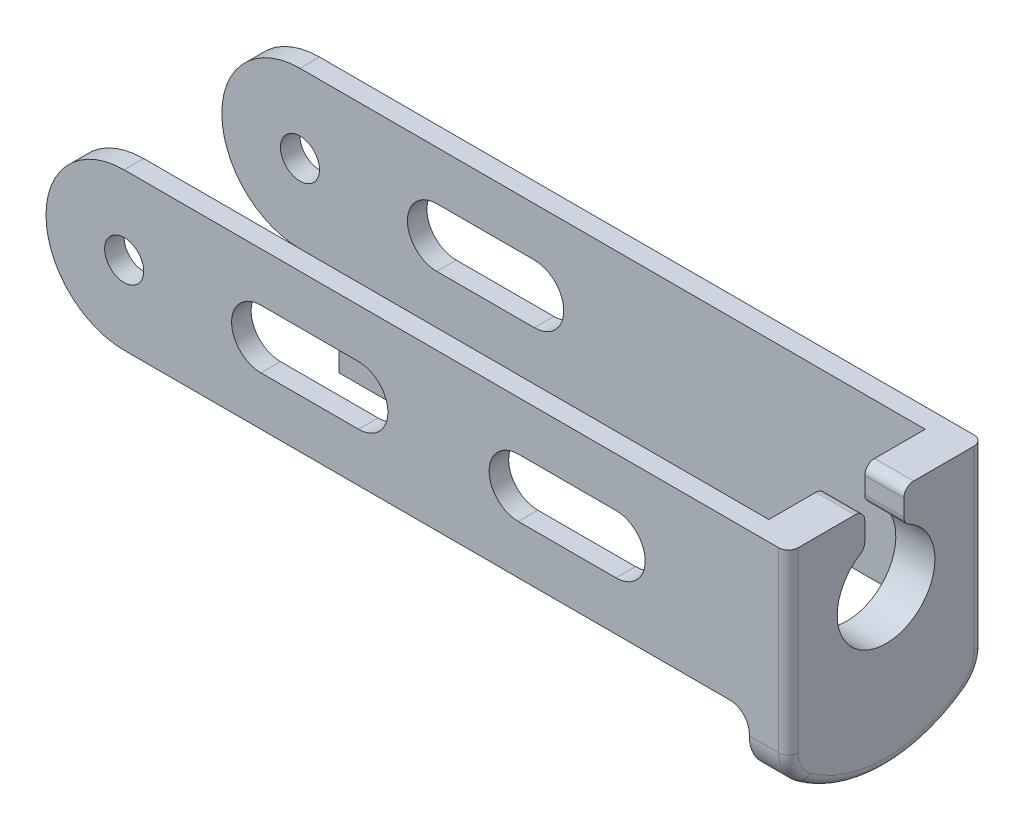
ISO-10303-21;
HEADER;
FILE_DESCRIPTION(('STEP AP214'),'2;1');
FILE_NAME('part.step','',(''),(''),'','','');
FILE_SCHEMA(('AUTOMOTIVE_DESIGN { 1 0 10303 214 1 1 1 1 }'));
ENDSEC;
DATA;
#1=APPLICATION_CONTEXT('core data for automotive mechanical design processes');
#2=APPLICATION_PROTOCOL_DEFINITION('international standard','automotive_design',2000,#1);
#3=PRODUCT_CONTEXT('',#1,'mechanical');
#4=PRODUCT('Part','Part','',(#3));
#5=PRODUCT_RELATED_PRODUCT_CATEGORY('part','',(#4));
#6=PRODUCT_DEFINITION_FORMATION('','',#4);
#7=PRODUCT_DEFINITION_CONTEXT('part definition',#1,'design');
#8=PRODUCT_DEFINITION('design','',#6,#7);
#9=PRODUCT_DEFINITION_SHAPE('','',#8);
#10=(LENGTH_UNIT() NAMED_UNIT(*) SI_UNIT(.MILLI.,.METRE.));
#11=(NAMED_UNIT(*) PLANE_ANGLE_UNIT() SI_UNIT($,.RADIAN.));
#12=(NAMED_UNIT(*) SI_UNIT($,.STERADIAN.) SOLID_ANGLE_UNIT());
#13=UNCERTAINTY_MEASURE_WITH_UNIT(LENGTH_MEASURE(1.E-05),#10,'distance_accuracy_value','');
#14=(GEOMETRIC_REPRESENTATION_CONTEXT(3) GLOBAL_UNCERTAINTY_ASSIGNED_CONTEXT((#13)) GLOBAL_UNIT_ASSIGNED_CONTEXT((#10,
#11,#12)) REPRESENTATION_CONTEXT('',''));
#15=CARTESIAN_POINT('',(0.,0.,0.));
#16=DIRECTION('',(0.,0.,1.));
#17=DIRECTION('',(1.,0.,0.));
#18=AXIS2_PLACEMENT_3D('',#15,#16,#17);
#19=CARTESIAN_POINT('',(0.,-3.,-10.));
#20=DIRECTION('',(0.,-1.,0.));
#21=DIRECTION('',(0.,0.,-1.));
#22=AXIS2_PLACEMENT_3D('',#19,#20,#21);
#23=PLANE('',#22);
#24=DIRECTION('',(0.,0.,1.));
#25=VECTOR('',#24,1.);
#26=CARTESIAN_POINT('',(-27.,-3.,-10.));
#27=LINE('',#26,#25);
#28=CARTESIAN_POINT('',(-27.,-3.,-10.));
#29=VERTEX_POINT('',#28);
#30=CARTESIAN_POINT('',(-27.,-3.,-9.));
#31=VERTEX_POINT('',#30);
#32=EDGE_CURVE('E319',#29,#31,#27,.T.);
#33=ORIENTED_EDGE('',*,*,#32,.T.);
#34=DIRECTION('',(1.,0.,0.));
#35=VECTOR('',#34,1.);
#36=CARTESIAN_POINT('',(0.,-3.,-9.));
#37=LINE('',#36,#35);
#38=CARTESIAN_POINT('',(-32.,-3.,-9.));
#39=VERTEX_POINT('',#38);
#40=EDGE_CURVE('E400',#39,#31,#37,.T.);
#41=ORIENTED_EDGE('',*,*,#40,.F.);
#42=DIRECTION('',(0.,0.,1.));
#43=VECTOR('',#42,1.);
#44=CARTESIAN_POINT('',(-32.,-3.,-10.));
#45=LINE('',#44,#43);
#46=CARTESIAN_POINT('',(-32.,-3.,-10.));
#47=VERTEX_POINT('',#46);
#48=EDGE_CURVE('E517',#47,#39,#45,.T.);
#49=ORIENTED_EDGE('',*,*,#48,.F.);
#50=DIRECTION('',(1.,0.,0.));
#51=VECTOR('',#50,1.);
#52=CARTESIAN_POINT('',(0.,-3.,-10.));
#53=LINE('',#52,#51);
#54=EDGE_CURVE('E500',#47,#29,#53,.T.);
#55=ORIENTED_EDGE('',*,*,#54,.T.);
#56=EDGE_LOOP('',(#33,#41,#49,#55));
#57=FACE_BOUND('',#56,.T.);
#58=ADVANCED_FACE('F32',(#57),#23,.T.);
#59=CARTESIAN_POINT('',(2.,5.,-10.));
#60=DIRECTION('',(1.,0.,0.));
#61=DIRECTION('',(0.,1.,0.));
#62=AXIS2_PLACEMENT_3D('',#59,#60,#61);
#63=PLANE('',#62);
#64=DIRECTION('',(0.,0.,1.));
#65=VECTOR('',#64,1.);
#66=CARTESIAN_POINT('',(2.,5.,-10.));
#67=LINE('',#66,#65);
#68=CARTESIAN_POINT('',(2.,5.,-3.41));
#69=VERTEX_POINT('',#68);
#70=CARTESIAN_POINT('',(2.,5.,-0.5));
#71=VERTEX_POINT('',#70);
#72=EDGE_CURVE('E516',#69,#71,#67,.T.);
#73=ORIENTED_EDGE('',*,*,#72,.T.);
#74=DIRECTION('',(0.,1.,0.));
#75=VECTOR('',#74,1.);
#76=CARTESIAN_POINT('',(2.,-4.08848734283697,-0.5));
#77=LINE('',#76,#75);
#78=CARTESIAN_POINT('',(2.,-4.08848734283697,-0.5));
#79=VERTEX_POINT('',#78);
#80=EDGE_CURVE('E625',#71,#79,#77,.F.);
#81=ORIENTED_EDGE('',*,*,#80,.T.);
#82=CARTESIAN_POINT('',(2.,-4.08848734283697,-2.));
#83=DIRECTION('',(1.,0.,0.));
#84=DIRECTION('',(0.,1.,0.));
#85=AXIS2_PLACEMENT_3D('',#82,#83,#84);
#86=CIRCLE('',#85,1.5);
#87=CARTESIAN_POINT('',(2.,-5.2978442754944,-1.11261293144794));
#88=VERTEX_POINT('',#87);
#89=EDGE_CURVE('E623',#79,#88,#86,.T.);
#90=ORIENTED_EDGE('',*,*,#89,.T.);
#91=CARTESIAN_POINT('',(2.,0.,-5.));
#92=DIRECTION('',(1.,0.,0.));
#93=DIRECTION('',(0.,1.,0.));
#94=AXIS2_PLACEMENT_3D('',#91,#92,#93);
#95=CIRCLE('',#94,6.57106781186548);
#96=CARTESIAN_POINT('',(2.,-5.2978442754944,-8.88738706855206));
#97=VERTEX_POINT('',#96);
#98=EDGE_CURVE('E621',#88,#97,#95,.T.);
#99=ORIENTED_EDGE('',*,*,#98,.T.);
#100=CARTESIAN_POINT('',(2.,-4.08848734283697,-8.));
#101=DIRECTION('',(1.,0.,0.));
#102=DIRECTION('',(0.,1.,0.));
#103=AXIS2_PLACEMENT_3D('',#100,#101,#102);
#104=CIRCLE('',#103,1.5);
#105=CARTESIAN_POINT('',(2.,-4.08848734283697,-9.5));
#106=VERTEX_POINT('',#105);
#107=EDGE_CURVE('E619',#97,#106,#104,.T.);
#108=ORIENTED_EDGE('',*,*,#107,.T.);
#109=DIRECTION('',(0.,1.,0.));
#110=VECTOR('',#109,1.);
#111=CARTESIAN_POINT('',(2.,5.,-9.5));
#112=LINE('',#111,#110);
#113=CARTESIAN_POINT('',(2.,5.,-9.5));
#114=VERTEX_POINT('',#113);
#115=EDGE_CURVE('E617',#106,#114,#112,.T.);
#116=ORIENTED_EDGE('',*,*,#115,.T.);
#117=CARTESIAN_POINT('',(2.,5.,-6.41));
#118=VERTEX_POINT('',#117);
#119=EDGE_CURVE('E514',#114,#118,#67,.T.);
#120=ORIENTED_EDGE('',*,*,#119,.T.);
#121=CARTESIAN_POINT('',(2.,4.5,-6.41));
#122=DIRECTION('',(1.,0.,0.));
#123=DIRECTION('',(0.,1.,0.));
#124=AXIS2_PLACEMENT_3D('',#121,#122,#123);
#125=CIRCLE('',#124,0.5);
#126=CARTESIAN_POINT('',(2.,4.5,-5.91));
#127=VERTEX_POINT('',#126);
#128=EDGE_CURVE('E591',#118,#127,#125,.T.);
#129=ORIENTED_EDGE('',*,*,#128,.T.);
#130=DIRECTION('',(0.,1.,0.));
#131=VECTOR('',#130,1.);
#132=CARTESIAN_POINT('',(2.,5.,-5.91));
#133=LINE('',#132,#131);
#134=CARTESIAN_POINT('',(2.,3.64799924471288,-5.91));
#135=VERTEX_POINT('',#134);
#136=EDGE_CURVE('E371',#135,#127,#133,.T.);
#137=ORIENTED_EDGE('',*,*,#136,.F.);
#138=CARTESIAN_POINT('',(2.,3.64799924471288,-6.41));
#139=DIRECTION('',(1.,0.,0.));
#140=DIRECTION('',(0.,1.,0.));
#141=AXIS2_PLACEMENT_3D('',#138,#139,#140);
#142=CIRCLE('',#141,0.5);
#143=CARTESIAN_POINT('',(2.,3.20666603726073,-6.175));
#144=VERTEX_POINT('',#143);
#145=EDGE_CURVE('E553',#135,#144,#142,.T.);
#146=ORIENTED_EDGE('',*,*,#145,.T.);
#147=CARTESIAN_POINT('',(2.,0.999999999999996,-5.));
#148=DIRECTION('',(1.,0.,0.));
#149=DIRECTION('',(0.,1.,0.));
#150=AXIS2_PLACEMENT_3D('',#147,#148,#149);
#151=CIRCLE('',#150,2.5);
#152=CARTESIAN_POINT('',(2.,3.11999410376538,-3.675));
#153=VERTEX_POINT('',#152);
#154=EDGE_CURVE('E379',#144,#153,#151,.F.);
#155=ORIENTED_EDGE('',*,*,#154,.T.);
#156=CARTESIAN_POINT('',(2.,3.54399292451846,-3.41));
#157=DIRECTION('',(1.,0.,0.));
#158=DIRECTION('',(0.,1.,0.));
#159=AXIS2_PLACEMENT_3D('',#156,#157,#158);
#160=CIRCLE('',#159,0.5);
#161=CARTESIAN_POINT('',(2.,3.54399292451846,-3.91));
#162=VERTEX_POINT('',#161);
#163=EDGE_CURVE('E550',#153,#162,#160,.T.);
#164=ORIENTED_EDGE('',*,*,#163,.T.);
#165=DIRECTION('',(0.,-1.,0.));
#166=VECTOR('',#165,1.);
#167=CARTESIAN_POINT('',(2.,2.30198104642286,-3.91));
#168=LINE('',#167,#166);
#169=CARTESIAN_POINT('',(2.,4.5,-3.91));
#170=VERTEX_POINT('',#169);
#171=EDGE_CURVE('E374',#170,#162,#168,.T.);
#172=ORIENTED_EDGE('',*,*,#171,.F.);
#173=CARTESIAN_POINT('',(2.,4.5,-3.41));
#174=DIRECTION('',(1.,0.,0.));
#175=DIRECTION('',(0.,1.,0.));
#176=AXIS2_PLACEMENT_3D('',#173,#174,#175);
#177=CIRCLE('',#176,0.5);
#178=EDGE_CURVE('E589',#170,#69,#177,.T.);
#179=ORIENTED_EDGE('',*,*,#178,.T.);
#180=EDGE_LOOP('',(#73,#81,#90,#99,#108,#116,#120,#129,#137,#146,#155,#164,#172,#179));
#181=FACE_BOUND('',#180,.T.);
#182=ADVANCED_FACE('F714',(#181),#63,.T.);
#183=CARTESIAN_POINT('',(0.,-3.,-10.));
#184=DIRECTION('',(-1.,0.,0.));
#185=DIRECTION('',(0.,-1.,0.));
#186=AXIS2_PLACEMENT_3D('',#183,#184,#185);
#187=PLANE('',#186);
#188=DIRECTION('',(0.,-1.,0.));
#189=VECTOR('',#188,1.);
#190=CARTESIAN_POINT('',(0.,-3.,-10.));
#191=LINE('',#190,#189);
#192=CARTESIAN_POINT('',(0.,-4.,-10.));
#193=VERTEX_POINT('',#192);
#194=CARTESIAN_POINT('',(0.,-4.08848734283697,-10.));
#195=VERTEX_POINT('',#194);
#196=EDGE_CURVE('E503',#193,#195,#191,.T.);
#197=ORIENTED_EDGE('',*,*,#196,.T.);
#198=CARTESIAN_POINT('',(0.,-4.08848734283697,-8.));
#199=DIRECTION('',(-1.,0.,0.));
#200=DIRECTION('',(0.,-1.,0.));
#201=AXIS2_PLACEMENT_3D('',#198,#199,#200);
#202=CIRCLE('',#201,2.);
#203=CARTESIAN_POINT('',(0.,-5.70096325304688,-9.18318275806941));
#204=VERTEX_POINT('',#203);
#205=EDGE_CURVE('E610',#195,#204,#202,.T.);
#206=ORIENTED_EDGE('',*,*,#205,.T.);
#207=CARTESIAN_POINT('',(0.,0.,-5.));
#208=DIRECTION('',(-1.,0.,0.));
#209=DIRECTION('',(0.,1.,0.));
#210=AXIS2_PLACEMENT_3D('',#207,#208,#209);
#211=CIRCLE('',#210,7.07106781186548);
#212=CARTESIAN_POINT('',(0.,-5.70096325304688,-0.81681724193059));
#213=VERTEX_POINT('',#212);
#214=EDGE_CURVE('E382',#204,#213,#211,.T.);
#215=ORIENTED_EDGE('',*,*,#214,.T.);
#216=CARTESIAN_POINT('',(0.,-4.08848734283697,-2.));
#217=DIRECTION('',(-1.,0.,0.));
#218=DIRECTION('',(0.,-1.,0.));
#219=AXIS2_PLACEMENT_3D('',#216,#217,#218);
#220=CIRCLE('',#219,2.);
#221=CARTESIAN_POINT('',(0.,-4.08848734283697,0.));
#222=VERTEX_POINT('',#221);
#223=EDGE_CURVE('E603',#213,#222,#220,.T.);
#224=ORIENTED_EDGE('',*,*,#223,.T.);
#225=DIRECTION('',(0.,-1.,0.));
#226=VECTOR('',#225,1.);
#227=CARTESIAN_POINT('',(0.,-3.,0.));
#228=LINE('',#227,#226);
#229=CARTESIAN_POINT('',(0.,-4.,0.));
#230=VERTEX_POINT('',#229);
#231=EDGE_CURVE('E491',#230,#222,#228,.T.);
#232=ORIENTED_EDGE('',*,*,#231,.F.);
#233=DIRECTION('',(0.,0.,1.));
#234=VECTOR('',#233,1.);
#235=CARTESIAN_POINT('',(0.,-4.,-10.));
#236=LINE('',#235,#234);
#237=CARTESIAN_POINT('',(0.,-4.,-0.999999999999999));
#238=VERTEX_POINT('',#237);
#239=EDGE_CURVE('E524',#230,#238,#236,.F.);
#240=ORIENTED_EDGE('',*,*,#239,.T.);
#241=DIRECTION('',(0.,1.,0.));
#242=VECTOR('',#241,1.);
#243=CARTESIAN_POINT('',(0.,-5.,-0.999999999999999));
#244=LINE('',#243,#242);
#245=CARTESIAN_POINT('',(0.,5.,-0.999999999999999));
#246=VERTEX_POINT('',#245);
#247=EDGE_CURVE('E393',#238,#246,#244,.T.);
#248=ORIENTED_EDGE('',*,*,#247,.T.);
#249=DIRECTION('',(0.,0.,-1.));
#250=VECTOR('',#249,1.);
#251=CARTESIAN_POINT('',(0.,5.,-9.));
#252=LINE('',#251,#250);
#253=CARTESIAN_POINT('',(0.,5.,-3.41));
#254=VERTEX_POINT('',#253);
#255=EDGE_CURVE('E388',#246,#254,#252,.T.);
#256=ORIENTED_EDGE('',*,*,#255,.T.);
#257=CARTESIAN_POINT('',(0.,4.5,-3.41));
#258=DIRECTION('',(-1.,0.,0.));
#259=DIRECTION('',(0.,-1.,0.));
#260=AXIS2_PLACEMENT_3D('',#257,#258,#259);
#261=CIRCLE('',#260,0.5);
#262=CARTESIAN_POINT('',(0.,4.5,-3.91));
#263=VERTEX_POINT('',#262);
#264=EDGE_CURVE('E582',#254,#263,#261,.T.);
#265=ORIENTED_EDGE('',*,*,#264,.T.);
#266=DIRECTION('',(0.,-1.,0.));
#267=VECTOR('',#266,1.);
#268=CARTESIAN_POINT('',(0.,2.30198104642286,-3.91));
#269=LINE('',#268,#267);
#270=CARTESIAN_POINT('',(0.,3.54399292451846,-3.91));
#271=VERTEX_POINT('',#270);
#272=EDGE_CURVE('E369',#263,#271,#269,.T.);
#273=ORIENTED_EDGE('',*,*,#272,.T.);
#274=CARTESIAN_POINT('',(0.,3.54399292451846,-3.41));
#275=DIRECTION('',(-1.,0.,0.));
#276=DIRECTION('',(0.,-1.,0.));
#277=AXIS2_PLACEMENT_3D('',#274,#275,#276);
#278=CIRCLE('',#277,0.5);
#279=CARTESIAN_POINT('',(0.,3.11999410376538,-3.675));
#280=VERTEX_POINT('',#279);
#281=EDGE_CURVE('E544',#271,#280,#278,.T.);
#282=ORIENTED_EDGE('',*,*,#281,.T.);
#283=CARTESIAN_POINT('',(0.,0.999999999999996,-5.));
#284=DIRECTION('',(1.,0.,0.));
#285=DIRECTION('',(0.,0.,-1.));
#286=AXIS2_PLACEMENT_3D('',#283,#284,#285);
#287=CIRCLE('',#286,2.5);
#288=CARTESIAN_POINT('',(0.,3.20666603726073,-6.175));
#289=VERTEX_POINT('',#288);
#290=EDGE_CURVE('E376',#280,#289,#287,.T.);
#291=ORIENTED_EDGE('',*,*,#290,.T.);
#292=CARTESIAN_POINT('',(0.,3.64799924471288,-6.41));
#293=DIRECTION('',(-1.,0.,0.));
#294=DIRECTION('',(0.,-1.,0.));
#295=AXIS2_PLACEMENT_3D('',#292,#293,#294);
#296=CIRCLE('',#295,0.5);
#297=CARTESIAN_POINT('',(0.,3.64799924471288,-5.91));
#298=VERTEX_POINT('',#297);
#299=EDGE_CURVE('E546',#289,#298,#296,.T.);
#300=ORIENTED_EDGE('',*,*,#299,.T.);
#301=DIRECTION('',(0.,1.,0.));
#302=VECTOR('',#301,1.);
#303=CARTESIAN_POINT('',(0.,5.,-5.91));
#304=LINE('',#303,#302);
#305=CARTESIAN_POINT('',(0.,4.5,-5.91));
#306=VERTEX_POINT('',#305);
#307=EDGE_CURVE('E360',#298,#306,#304,.T.);
#308=ORIENTED_EDGE('',*,*,#307,.T.);
#309=CARTESIAN_POINT('',(0.,4.5,-6.41));
#310=DIRECTION('',(-1.,0.,0.));
#311=DIRECTION('',(0.,-1.,0.));
#312=AXIS2_PLACEMENT_3D('',#309,#310,#311);
#313=CIRCLE('',#312,0.5);
#314=CARTESIAN_POINT('',(0.,5.,-6.41));
#315=VERTEX_POINT('',#314);
#316=EDGE_CURVE('E584',#306,#315,#313,.T.);
#317=ORIENTED_EDGE('',*,*,#316,.T.);
#318=CARTESIAN_POINT('',(0.,5.,-9.));
#319=VERTEX_POINT('',#318);
#320=EDGE_CURVE('E387',#315,#319,#252,.T.);
#321=ORIENTED_EDGE('',*,*,#320,.T.);
#322=DIRECTION('',(0.,1.,0.));
#323=VECTOR('',#322,1.);
#324=CARTESIAN_POINT('',(0.,-5.,-9.));
#325=LINE('',#324,#323);
#326=CARTESIAN_POINT('',(0.,-4.,-9.));
#327=VERTEX_POINT('',#326);
#328=EDGE_CURVE('E394',#327,#319,#325,.T.);
#329=ORIENTED_EDGE('',*,*,#328,.F.);
#330=EDGE_CURVE('E523',#327,#193,#236,.F.);
#331=ORIENTED_EDGE('',*,*,#330,.T.);
#332=EDGE_LOOP('',(#197,#206,#215,#224,#232,#240,#248,#256,#265,#273,#282,#291,#300,#308,#317,
#321,#329,#331));
#333=FACE_BOUND('',#332,.T.);
#334=ADVANCED_FACE('F677',(#333),#187,.T.);
#335=CARTESIAN_POINT('',(-32.,5.,-10.));
#336=DIRECTION('',(0.,1.,0.));
#337=DIRECTION('',(0.,0.,1.));
#338=AXIS2_PLACEMENT_3D('',#335,#336,#337);
#339=PLANE('',#338);
#340=ORIENTED_EDGE('',*,*,#119,.F.);
#341=CARTESIAN_POINT('',(1.5,5.,-9.5));
#342=DIRECTION('',(0.,1.,0.));
#343=DIRECTION('',(0.,0.,1.));
#344=AXIS2_PLACEMENT_3D('',#341,#342,#343);
#345=CIRCLE('',#344,0.5);
#346=CARTESIAN_POINT('',(1.5,5.,-10.));
#347=VERTEX_POINT('',#346);
#348=EDGE_CURVE('E40',#114,#347,#345,.T.);
#349=ORIENTED_EDGE('',*,*,#348,.T.);
#350=DIRECTION('',(-1.,0.,0.));
#351=VECTOR('',#350,1.);
#352=CARTESIAN_POINT('',(-32.,5.,-10.));
#353=LINE('',#352,#351);
#354=CARTESIAN_POINT('',(-32.,5.,-10.));
#355=VERTEX_POINT('',#354);
#356=EDGE_CURVE('E506',#347,#355,#353,.T.);
#357=ORIENTED_EDGE('',*,*,#356,.T.);
#358=DIRECTION('',(0.,0.,1.));
#359=VECTOR('',#358,1.);
#360=CARTESIAN_POINT('',(-32.,5.,-10.));
#361=LINE('',#360,#359);
#362=CARTESIAN_POINT('',(-32.,5.,-9.));
#363=VERTEX_POINT('',#362);
#364=EDGE_CURVE('E509',#355,#363,#361,.T.);
#365=ORIENTED_EDGE('',*,*,#364,.T.);
#366=DIRECTION('',(-1.,0.,0.));
#367=VECTOR('',#366,1.);
#368=CARTESIAN_POINT('',(0.,5.,-9.));
#369=LINE('',#368,#367);
#370=EDGE_CURVE('E391',#319,#363,#369,.T.);
#371=ORIENTED_EDGE('',*,*,#370,.F.);
#372=ORIENTED_EDGE('',*,*,#320,.F.);
#373=DIRECTION('',(-1.,0.,0.));
#374=VECTOR('',#373,1.);
#375=CARTESIAN_POINT('',(-32.,5.,-6.41));
#376=LINE('',#375,#374);
#377=EDGE_CURVE('E586',#315,#118,#376,.F.);
#378=ORIENTED_EDGE('',*,*,#377,.T.);
#379=EDGE_LOOP('',(#340,#349,#357,#365,#371,#372,#378));
#380=FACE_BOUND('',#379,.T.);
#381=ADVANCED_FACE('F779',(#380),#339,.T.);
#382=DIRECTION('',(-1.,0.,0.));
#383=VECTOR('',#382,1.);
#384=CARTESIAN_POINT('',(-32.,5.,0.));
#385=LINE('',#384,#383);
#386=CARTESIAN_POINT('',(1.5,5.,0.));
#387=VERTEX_POINT('',#386);
#388=CARTESIAN_POINT('',(-32.,5.,0.));
#389=VERTEX_POINT('',#388);
#390=EDGE_CURVE('E494',#387,#389,#385,.T.);
#391=ORIENTED_EDGE('',*,*,#390,.F.);
#392=CARTESIAN_POINT('',(1.5,5.,-0.5));
#393=DIRECTION('',(0.,1.,0.));
#394=DIRECTION('',(0.,0.,1.));
#395=AXIS2_PLACEMENT_3D('',#392,#393,#394);
#396=CIRCLE('',#395,0.5);
#397=EDGE_CURVE('E615',#387,#71,#396,.T.);
#398=ORIENTED_EDGE('',*,*,#397,.T.);
#399=ORIENTED_EDGE('',*,*,#72,.F.);
#400=DIRECTION('',(-1.,0.,0.));
#401=VECTOR('',#400,1.);
#402=CARTESIAN_POINT('',(-32.,5.,-3.41));
#403=LINE('',#402,#401);
#404=EDGE_CURVE('E593',#69,#254,#403,.T.);
#405=ORIENTED_EDGE('',*,*,#404,.T.);
#406=ORIENTED_EDGE('',*,*,#255,.F.);
#407=DIRECTION('',(1.,0.,0.));
#408=VECTOR('',#407,1.);
#409=CARTESIAN_POINT('',(0.,5.,-0.999999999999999));
#410=LINE('',#409,#408);
#411=CARTESIAN_POINT('',(-32.,5.,-1.));
#412=VERTEX_POINT('',#411);
#413=EDGE_CURVE('E385',#412,#246,#410,.T.);
#414=ORIENTED_EDGE('',*,*,#413,.F.);
#415=EDGE_CURVE('E513',#412,#389,#361,.T.);
#416=ORIENTED_EDGE('',*,*,#415,.T.);
#417=EDGE_LOOP('',(#391,#398,#399,#405,#406,#414,#416));
#418=FACE_BOUND('',#417,.T.);
#419=ADVANCED_FACE('F699',(#418),#339,.T.);
#420=CARTESIAN_POINT('',(3.,0.999999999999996,-5.));
#421=DIRECTION('',(-1.,0.,0.));
#422=DIRECTION('',(0.,0.,1.));
#423=AXIS2_PLACEMENT_3D('',#420,#421,#422);
#424=CYLINDRICAL_SURFACE('',#423,2.5);
#425=ORIENTED_EDGE('',*,*,#154,.F.);
#426=DIRECTION('',(-1.,0.,0.));
#427=VECTOR('',#426,1.);
#428=CARTESIAN_POINT('',(3.,3.20666603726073,-6.175));
#429=LINE('',#428,#427);
#430=EDGE_CURVE('E541',#144,#289,#429,.T.);
#431=ORIENTED_EDGE('',*,*,#430,.T.);
#432=ORIENTED_EDGE('',*,*,#290,.F.);
#433=DIRECTION('',(-1.,0.,0.));
#434=VECTOR('',#433,1.);
#435=CARTESIAN_POINT('',(3.,3.11999410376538,-3.675));
#436=LINE('',#435,#434);
#437=EDGE_CURVE('E538',#280,#153,#436,.F.);
#438=ORIENTED_EDGE('',*,*,#437,.T.);
#439=EDGE_LOOP('',(#425,#431,#432,#438));
#440=FACE_BOUND('',#439,.T.);
#441=ADVANCED_FACE('F797',(#440),#424,.F.);
#442=CARTESIAN_POINT('',(-32.,0.999999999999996,-10.));
#443=DIRECTION('',(0.,0.,1.));
#444=DIRECTION('',(1.,0.,0.));
#445=AXIS2_PLACEMENT_3D('',#442,#443,#444);
#446=CYLINDRICAL_SURFACE('',#445,4.);
#447=CARTESIAN_POINT('',(-32.,0.999999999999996,-0.999999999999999));
#448=DIRECTION('',(0.,0.,1.));
#449=DIRECTION('',(1.,0.,0.));
#450=AXIS2_PLACEMENT_3D('',#447,#448,#449);
#451=CIRCLE('',#450,4.);
#452=CARTESIAN_POINT('',(-32.,-3.,-1.));
#453=VERTEX_POINT('',#452);
#454=EDGE_CURVE('E423',#453,#412,#451,.F.);
#455=ORIENTED_EDGE('',*,*,#454,.F.);
#456=CARTESIAN_POINT('',(-32.,-3.,0.));
#457=VERTEX_POINT('',#456);
#458=EDGE_CURVE('E508',#453,#457,#45,.T.);
#459=ORIENTED_EDGE('',*,*,#458,.T.);
#460=CARTESIAN_POINT('',(-32.,0.999999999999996,0.));
#461=DIRECTION('',(0.,0.,1.));
#462=DIRECTION('',(-1.,0.,0.));
#463=AXIS2_PLACEMENT_3D('',#460,#461,#462);
#464=CIRCLE('',#463,4.);
#465=EDGE_CURVE('E474',#389,#457,#464,.T.);
#466=ORIENTED_EDGE('',*,*,#465,.F.);
#467=ORIENTED_EDGE('',*,*,#415,.F.);
#468=EDGE_LOOP('',(#455,#459,#466,#467));
#469=FACE_BOUND('',#468,.T.);
#470=ADVANCED_FACE('F693',(#469),#446,.T.);
#471=DIRECTION('',(0.,0.,1.));
#472=VECTOR('',#471,1.);
#473=CARTESIAN_POINT('',(-1.,-3.,0.));
#474=LINE('',#473,#472);
#475=CARTESIAN_POINT('',(-1.,-3.,-0.999999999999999));
#476=VERTEX_POINT('',#475);
#477=CARTESIAN_POINT('',(-1.,-3.,0.));
#478=VERTEX_POINT('',#477);
#479=EDGE_CURVE('E512',#476,#478,#474,.T.);
#480=ORIENTED_EDGE('',*,*,#479,.T.);
#481=DIRECTION('',(1.,0.,0.));
#482=VECTOR('',#481,1.);
#483=CARTESIAN_POINT('',(0.,-3.,0.));
#484=LINE('',#483,#482);
#485=EDGE_CURVE('E489',#457,#478,#484,.T.);
#486=ORIENTED_EDGE('',*,*,#485,.F.);
#487=ORIENTED_EDGE('',*,*,#458,.F.);
#488=DIRECTION('',(-1.,0.,0.));
#489=VECTOR('',#488,1.);
#490=CARTESIAN_POINT('',(0.,-3.,-0.999999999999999));
#491=LINE('',#490,#489);
#492=EDGE_CURVE('E421',#476,#453,#491,.T.);
#493=ORIENTED_EDGE('',*,*,#492,.F.);
#494=EDGE_LOOP('',(#480,#486,#487,#493));
#495=FACE_BOUND('',#494,.T.);
#496=ADVANCED_FACE('F689',(#495),#23,.T.);
#497=CARTESIAN_POINT('',(-25.,0.999999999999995,-10.));
#498=DIRECTION('',(0.,0.,1.));
#499=DIRECTION('',(1.,0.,0.));
#500=AXIS2_PLACEMENT_3D('',#497,#498,#499);
#501=CYLINDRICAL_SURFACE('',#500,1.5);
#502=DIRECTION('',(0.,0.,1.));
#503=VECTOR('',#502,1.);
#504=CARTESIAN_POINT('',(-25.,-0.500000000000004,-10.));
#505=LINE('',#504,#503);
#506=CARTESIAN_POINT('',(-25.,-0.500000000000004,-0.999999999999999));
#507=VERTEX_POINT('',#506);
#508=CARTESIAN_POINT('',(-25.,-0.500000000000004,0.));
#509=VERTEX_POINT('',#508);
#510=EDGE_CURVE('E470',#507,#509,#505,.T.);
#511=ORIENTED_EDGE('',*,*,#510,.F.);
#512=CARTESIAN_POINT('',(-25.,0.999999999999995,-0.999999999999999));
#513=DIRECTION('',(0.,0.,1.));
#514=DIRECTION('',(1.,0.,0.));
#515=AXIS2_PLACEMENT_3D('',#512,#513,#514);
#516=CIRCLE('',#515,1.5);
#517=CARTESIAN_POINT('',(-25.,2.5,-0.999999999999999));
#518=VERTEX_POINT('',#517);
#519=EDGE_CURVE('E437',#507,#518,#516,.F.);
#520=ORIENTED_EDGE('',*,*,#519,.T.);
#521=DIRECTION('',(0.,0.,1.));
#522=VECTOR('',#521,1.);
#523=CARTESIAN_POINT('',(-25.,2.5,-10.));
#524=LINE('',#523,#522);
#525=CARTESIAN_POINT('',(-25.,2.5,0.));
#526=VERTEX_POINT('',#525);
#527=EDGE_CURVE('E475',#518,#526,#524,.T.);
#528=ORIENTED_EDGE('',*,*,#527,.T.);
#529=CARTESIAN_POINT('',(-25.,0.999999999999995,0.));
#530=DIRECTION('',(0.,0.,1.));
#531=DIRECTION('',(1.,0.,0.));
#532=AXIS2_PLACEMENT_3D('',#529,#530,#531);
#533=CIRCLE('',#532,1.5);
#534=EDGE_CURVE('E446',#526,#509,#533,.T.);
#535=ORIENTED_EDGE('',*,*,#534,.T.);
#536=EDGE_LOOP('',(#511,#520,#528,#535));
#537=FACE_BOUND('',#536,.T.);
#538=ADVANCED_FACE('F740',(#537),#501,.F.);
#539=CARTESIAN_POINT('',(-25.,2.5,-10.));
#540=DIRECTION('',(0.,1.,0.));
#541=DIRECTION('',(-1.,0.,0.));
#542=AXIS2_PLACEMENT_3D('',#539,#540,#541);
#543=PLANE('',#542);
#544=ORIENTED_EDGE('',*,*,#527,.F.);
#545=DIRECTION('',(1.,0.,0.));
#546=VECTOR('',#545,1.);
#547=CARTESIAN_POINT('',(-25.,2.5,-0.999999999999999));
#548=LINE('',#547,#546);
#549=CARTESIAN_POINT('',(-20.,2.5,-0.999999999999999));
#550=VERTEX_POINT('',#549);
#551=EDGE_CURVE('E434',#518,#550,#548,.T.);
#552=ORIENTED_EDGE('',*,*,#551,.T.);
#553=DIRECTION('',(0.,0.,1.));
#554=VECTOR('',#553,1.);
#555=CARTESIAN_POINT('',(-20.,2.5,-10.));
#556=LINE('',#555,#554);
#557=CARTESIAN_POINT('',(-20.,2.5,0.));
#558=VERTEX_POINT('',#557);
#559=EDGE_CURVE('E479',#550,#558,#556,.T.);
#560=ORIENTED_EDGE('',*,*,#559,.T.);
#561=DIRECTION('',(-1.,0.,0.));
#562=VECTOR('',#561,1.);
#563=CARTESIAN_POINT('',(-25.,2.5,0.));
#564=LINE('',#563,#562);
#565=EDGE_CURVE('E455',#558,#526,#564,.T.);
#566=ORIENTED_EDGE('',*,*,#565,.T.);
#567=EDGE_LOOP('',(#544,#552,#560,#566));
#568=FACE_BOUND('',#567,.T.);
#569=ADVANCED_FACE('F843',(#568),#543,.F.);
#570=CARTESIAN_POINT('',(-20.,0.999999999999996,-10.));
#571=DIRECTION('',(0.,0.,1.));
#572=DIRECTION('',(1.,0.,0.));
#573=AXIS2_PLACEMENT_3D('',#570,#571,#572);
#574=CYLINDRICAL_SURFACE('',#573,1.5);
#575=ORIENTED_EDGE('',*,*,#559,.F.);
#576=CARTESIAN_POINT('',(-20.,0.999999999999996,-0.999999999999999));
#577=DIRECTION('',(0.,0.,1.));
#578=DIRECTION('',(1.,0.,0.));
#579=AXIS2_PLACEMENT_3D('',#576,#577,#578);
#580=CIRCLE('',#579,1.5);
#581=CARTESIAN_POINT('',(-20.,-0.500000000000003,-0.999999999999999));
#582=VERTEX_POINT('',#581);
#583=EDGE_CURVE('E431',#550,#582,#580,.F.);
#584=ORIENTED_EDGE('',*,*,#583,.T.);
#585=DIRECTION('',(0.,0.,1.));
#586=VECTOR('',#585,1.);
#587=CARTESIAN_POINT('',(-20.,-0.500000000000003,-10.));
#588=LINE('',#587,#586);
#589=CARTESIAN_POINT('',(-20.,-0.500000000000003,0.));
#590=VERTEX_POINT('',#589);
#591=EDGE_CURVE('E483',#582,#590,#588,.T.);
#592=ORIENTED_EDGE('',*,*,#591,.T.);
#593=CARTESIAN_POINT('',(-20.,0.999999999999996,0.));
#594=DIRECTION('',(0.,0.,1.));
#595=DIRECTION('',(-1.,0.,0.));
#596=AXIS2_PLACEMENT_3D('',#593,#594,#595);
#597=CIRCLE('',#596,1.5);
#598=EDGE_CURVE('E452',#590,#558,#597,.T.);
#599=ORIENTED_EDGE('',*,*,#598,.T.);
#600=EDGE_LOOP('',(#575,#584,#592,#599));
#601=FACE_BOUND('',#600,.T.);
#602=ADVANCED_FACE('F847',(#601),#574,.F.);
#603=CARTESIAN_POINT('',(-20.,-0.500000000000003,-10.));
#604=DIRECTION('',(0.,-1.,0.));
#605=DIRECTION('',(1.,0.,0.));
#606=AXIS2_PLACEMENT_3D('',#603,#604,#605);
#607=PLANE('',#606);
#608=ORIENTED_EDGE('',*,*,#591,.F.);
#609=DIRECTION('',(-1.,0.,0.));
#610=VECTOR('',#609,1.);
#611=CARTESIAN_POINT('',(-20.,-0.500000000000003,-0.999999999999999));
#612=LINE('',#611,#610);
#613=EDGE_CURVE('E428',#582,#507,#612,.T.);
#614=ORIENTED_EDGE('',*,*,#613,.T.);
#615=ORIENTED_EDGE('',*,*,#510,.T.);
#616=DIRECTION('',(1.,0.,0.));
#617=VECTOR('',#616,1.);
#618=CARTESIAN_POINT('',(-20.,-0.500000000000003,0.));
#619=LINE('',#618,#617);
#620=EDGE_CURVE('E449',#509,#590,#619,.T.);
#621=ORIENTED_EDGE('',*,*,#620,.T.);
#622=EDGE_LOOP('',(#608,#614,#615,#621));
#623=FACE_BOUND('',#622,.T.);
#624=ADVANCED_FACE('F851',(#623),#607,.F.);
#625=CARTESIAN_POINT('',(-32.,0.999999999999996,-10.));
#626=DIRECTION('',(0.,0.,1.));
#627=DIRECTION('',(1.,0.,0.));
#628=AXIS2_PLACEMENT_3D('',#625,#626,#627);
#629=CYLINDRICAL_SURFACE('',#628,0.999999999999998);
#630=CARTESIAN_POINT('',(-32.,0.999999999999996,-0.999999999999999));
#631=DIRECTION('',(0.,0.,1.));
#632=DIRECTION('',(1.,0.,0.));
#633=AXIS2_PLACEMENT_3D('',#630,#631,#632);
#634=CIRCLE('',#633,0.999999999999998);
#635=CARTESIAN_POINT('',(-31.,0.999999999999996,-0.999999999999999));
#636=VERTEX_POINT('',#635);
#637=EDGE_CURVE('E425',#636,#636,#634,.F.);
#638=ORIENTED_EDGE('',*,*,#637,.T.);
#639=EDGE_LOOP('',(#638));
#640=FACE_BOUND('',#639,.T.);
#641=CARTESIAN_POINT('',(-32.,0.999999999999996,0.));
#642=DIRECTION('',(0.,0.,1.));
#643=DIRECTION('',(1.,0.,0.));
#644=AXIS2_PLACEMENT_3D('',#641,#642,#643);
#645=CIRCLE('',#644,0.999999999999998);
#646=CARTESIAN_POINT('',(-31.,0.999999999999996,0.));
#647=VERTEX_POINT('',#646);
#648=EDGE_CURVE('E440',#647,#647,#645,.T.);
#649=ORIENTED_EDGE('',*,*,#648,.T.);
#650=EDGE_LOOP('',(#649));
#651=FACE_BOUND('',#650,.T.);
#652=ADVANCED_FACE('F836',(#640,#651),#629,.F.);
#653=CARTESIAN_POINT('',(-1.,-4.,-10.));
#654=DIRECTION('',(0.,0.,-1.));
#655=DIRECTION('',(-1.,0.,0.));
#656=AXIS2_PLACEMENT_3D('',#653,#654,#655);
#657=CYLINDRICAL_SURFACE('',#656,1.);
#658=ORIENTED_EDGE('',*,*,#479,.F.);
#659=CARTESIAN_POINT('',(-1.,-4.,-0.999999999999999));
#660=DIRECTION('',(0.,0.,1.));
#661=DIRECTION('',(1.,0.,0.));
#662=AXIS2_PLACEMENT_3D('',#659,#660,#661);
#663=CIRCLE('',#662,1.);
#664=EDGE_CURVE('E535',#476,#238,#663,.F.);
#665=ORIENTED_EDGE('',*,*,#664,.T.);
#666=ORIENTED_EDGE('',*,*,#239,.F.);
#667=CARTESIAN_POINT('',(-1.,-4.,0.));
#668=DIRECTION('',(0.,0.,-1.));
#669=DIRECTION('',(-1.,0.,0.));
#670=AXIS2_PLACEMENT_3D('',#667,#668,#669);
#671=CIRCLE('',#670,1.);
#672=EDGE_CURVE('E527',#478,#230,#671,.T.);
#673=ORIENTED_EDGE('',*,*,#672,.F.);
#674=EDGE_LOOP('',(#658,#665,#666,#673));
#675=FACE_BOUND('',#674,.T.);
#676=ADVANCED_FACE('F680',(#675),#657,.F.);
#677=CARTESIAN_POINT('',(-32.,0.999999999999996,-9.));
#678=DIRECTION('',(0.,0.,-1.));
#679=DIRECTION('',(-1.,0.,0.));
#680=AXIS2_PLACEMENT_3D('',#677,#678,#679);
#681=CIRCLE('',#680,4.);
#682=EDGE_CURVE('E403',#363,#39,#681,.F.);
#683=ORIENTED_EDGE('',*,*,#682,.F.);
#684=ORIENTED_EDGE('',*,*,#364,.F.);
#685=CARTESIAN_POINT('',(-32.,0.999999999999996,-10.));
#686=DIRECTION('',(0.,0.,1.));
#687=DIRECTION('',(-1.,0.,0.));
#688=AXIS2_PLACEMENT_3D('',#685,#686,#687);
#689=CIRCLE('',#688,4.);
#690=EDGE_CURVE('E496',#355,#47,#689,.T.);
#691=ORIENTED_EDGE('',*,*,#690,.T.);
#692=ORIENTED_EDGE('',*,*,#48,.T.);
#693=EDGE_LOOP('',(#683,#684,#691,#692));
#694=FACE_BOUND('',#693,.T.);
#695=ADVANCED_FACE('F34',(#694),#446,.T.);
#696=DIRECTION('',(0.,0.,1.));
#697=VECTOR('',#696,1.);
#698=CARTESIAN_POINT('',(-23.6744821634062,-3.,-10.));
#699=LINE('',#698,#697);
#700=CARTESIAN_POINT('',(-23.6744821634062,-3.,-10.));
#701=VERTEX_POINT('',#700);
#702=CARTESIAN_POINT('',(-23.6744821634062,-3.,-9.));
#703=VERTEX_POINT('',#702);
#704=EDGE_CURVE('E343',#701,#703,#699,.T.);
#705=ORIENTED_EDGE('',*,*,#704,.F.);
#706=CARTESIAN_POINT('',(-1.,-3.,-10.));
#707=VERTEX_POINT('',#706);
#708=EDGE_CURVE('E499',#701,#707,#53,.T.);
#709=ORIENTED_EDGE('',*,*,#708,.T.);
#710=CARTESIAN_POINT('',(-1.,-3.,-9.));
#711=VERTEX_POINT('',#710);
#712=EDGE_CURVE('E520',#707,#711,#474,.T.);
#713=ORIENTED_EDGE('',*,*,#712,.T.);
#714=EDGE_CURVE('E397',#703,#711,#37,.T.);
#715=ORIENTED_EDGE('',*,*,#714,.F.);
#716=EDGE_LOOP('',(#705,#709,#713,#715));
#717=FACE_BOUND('',#716,.T.);
#718=ADVANCED_FACE('F733',(#717),#23,.T.);
#719=CARTESIAN_POINT('',(-32.,0.999999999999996,-10.));
#720=DIRECTION('',(0.,0.,-1.));
#721=DIRECTION('',(-1.,0.,0.));
#722=AXIS2_PLACEMENT_3D('',#719,#720,#721);
#723=PLANE('',#722);
#724=CARTESIAN_POINT('',(-32.,0.999999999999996,-10.));
#725=DIRECTION('',(0.,0.,1.));
#726=DIRECTION('',(1.,0.,0.));
#727=AXIS2_PLACEMENT_3D('',#724,#725,#726);
#728=CIRCLE('',#727,0.999999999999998);
#729=CARTESIAN_POINT('',(-31.,0.999999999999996,-10.));
#730=VERTEX_POINT('',#729);
#731=EDGE_CURVE('E443',#730,#730,#728,.T.);
#732=ORIENTED_EDGE('',*,*,#731,.T.);
#733=EDGE_LOOP('',(#732));
#734=FACE_BOUND('',#733,.T.);
#735=CARTESIAN_POINT('',(-25.,0.999999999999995,-10.));
#736=DIRECTION('',(0.,0.,1.));
#737=DIRECTION('',(1.,0.,0.));
#738=AXIS2_PLACEMENT_3D('',#735,#736,#737);
#739=CIRCLE('',#738,1.5);
#740=CARTESIAN_POINT('',(-25.,2.5,-10.));
#741=VERTEX_POINT('',#740);
#742=CARTESIAN_POINT('',(-25.,-0.500000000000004,-10.));
#743=VERTEX_POINT('',#742);
#744=EDGE_CURVE('E458',#741,#743,#739,.T.);
#745=ORIENTED_EDGE('',*,*,#744,.T.);
#746=DIRECTION('',(1.,0.,0.));
#747=VECTOR('',#746,1.);
#748=CARTESIAN_POINT('',(-20.,-0.500000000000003,-10.));
#749=LINE('',#748,#747);
#750=CARTESIAN_POINT('',(-20.,-0.500000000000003,-10.));
#751=VERTEX_POINT('',#750);
#752=EDGE_CURVE('E461',#743,#751,#749,.T.);
#753=ORIENTED_EDGE('',*,*,#752,.T.);
#754=CARTESIAN_POINT('',(-20.,0.999999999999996,-10.));
#755=DIRECTION('',(0.,0.,1.));
#756=DIRECTION('',(-1.,0.,0.));
#757=AXIS2_PLACEMENT_3D('',#754,#755,#756);
#758=CIRCLE('',#757,1.5);
#759=CARTESIAN_POINT('',(-20.,2.5,-10.));
#760=VERTEX_POINT('',#759);
#761=EDGE_CURVE('E464',#751,#760,#758,.T.);
#762=ORIENTED_EDGE('',*,*,#761,.T.);
#763=DIRECTION('',(-1.,0.,0.));
#764=VECTOR('',#763,1.);
#765=CARTESIAN_POINT('',(-25.,2.5,-10.));
#766=LINE('',#765,#764);
#767=EDGE_CURVE('E467',#760,#741,#766,.T.);
#768=ORIENTED_EDGE('',*,*,#767,.T.);
#769=EDGE_LOOP('',(#745,#753,#762,#768));
#770=FACE_BOUND('',#769,.T.);
#771=ORIENTED_EDGE('',*,*,#356,.F.);
#772=DIRECTION('',(0.,1.,0.));
#773=VECTOR('',#772,1.);
#774=CARTESIAN_POINT('',(1.5,0.999999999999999,-10.));
#775=LINE('',#774,#773);
#776=CARTESIAN_POINT('',(1.5,-4.08848734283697,-10.));
#777=VERTEX_POINT('',#776);
#778=EDGE_CURVE('E11',#347,#777,#775,.F.);
#779=ORIENTED_EDGE('',*,*,#778,.T.);
#780=DIRECTION('',(-1.,0.,0.));
#781=VECTOR('',#780,1.);
#782=CARTESIAN_POINT('',(-32.,-4.08848734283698,-10.));
#783=LINE('',#782,#781);
#784=EDGE_CURVE('E608',#777,#195,#783,.T.);
#785=ORIENTED_EDGE('',*,*,#784,.T.);
#786=ORIENTED_EDGE('',*,*,#196,.F.);
#787=CARTESIAN_POINT('',(-1.,-4.,-10.));
#788=DIRECTION('',(0.,0.,-1.));
#789=DIRECTION('',(-1.,0.,0.));
#790=AXIS2_PLACEMENT_3D('',#787,#788,#789);
#791=CIRCLE('',#790,1.);
#792=EDGE_CURVE('E529',#193,#707,#791,.F.);
#793=ORIENTED_EDGE('',*,*,#792,.T.);
#794=ORIENTED_EDGE('',*,*,#708,.F.);
#795=DIRECTION('',(0.,1.,0.));
#796=VECTOR('',#795,1.);
#797=CARTESIAN_POINT('',(-23.6744821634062,-4.5,-10.));
#798=LINE('',#797,#796);
#799=CARTESIAN_POINT('',(-23.6744821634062,-4.,-10.));
#800=VERTEX_POINT('',#799);
#801=EDGE_CURVE('E334',#800,#701,#798,.T.);
#802=ORIENTED_EDGE('',*,*,#801,.F.);
#803=DIRECTION('',(1.,0.,0.));
#804=VECTOR('',#803,1.);
#805=CARTESIAN_POINT('',(-32.,-4.,-10.));
#806=LINE('',#805,#804);
#807=CARTESIAN_POINT('',(-27.,-4.,-10.));
#808=VERTEX_POINT('',#807);
#809=EDGE_CURVE('E576',#800,#808,#806,.F.);
#810=ORIENTED_EDGE('',*,*,#809,.T.);
#811=DIRECTION('',(0.,-1.,0.));
#812=VECTOR('',#811,1.);
#813=CARTESIAN_POINT('',(-27.,-3.,-10.));
#814=LINE('',#813,#812);
#815=EDGE_CURVE('E338',#29,#808,#814,.T.);
#816=ORIENTED_EDGE('',*,*,#815,.F.);
#817=ORIENTED_EDGE('',*,*,#54,.F.);
#818=ORIENTED_EDGE('',*,*,#690,.F.);
#819=EDGE_LOOP('',(#771,#779,#785,#786,#793,#794,#802,#810,#816,#817,#818));
#820=FACE_BOUND('',#819,.T.);
#821=ADVANCED_FACE('F742',(#734,#770,#820),#723,.T.);
#822=CARTESIAN_POINT('',(-32.,0.999999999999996,0.));
#823=DIRECTION('',(0.,0.,-1.));
#824=DIRECTION('',(-1.,0.,0.));
#825=AXIS2_PLACEMENT_3D('',#822,#823,#824);
#826=PLANE('',#825);
#827=DIRECTION('',(1.,0.,0.));
#828=VECTOR('',#827,1.);
#829=CARTESIAN_POINT('',(-6.82430955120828,-0.500000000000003,0.));
#830=LINE('',#829,#828);
#831=CARTESIAN_POINT('',(-11.8243095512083,-0.500000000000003,0.));
#832=VERTEX_POINT('',#831);
#833=CARTESIAN_POINT('',(-6.82430955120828,-0.500000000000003,0.));
#834=VERTEX_POINT('',#833);
#835=EDGE_CURVE('E348',#832,#834,#830,.T.);
#836=ORIENTED_EDGE('',*,*,#835,.F.);
#837=CARTESIAN_POINT('',(-11.8243095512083,0.993351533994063,0.));
#838=DIRECTION('',(0.,0.,1.));
#839=DIRECTION('',(-1.,0.,0.));
#840=AXIS2_PLACEMENT_3D('',#837,#838,#839);
#841=CIRCLE('',#840,1.49335153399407);
#842=CARTESIAN_POINT('',(-11.8243095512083,2.48670306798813,0.));
#843=VERTEX_POINT('',#842);
#844=EDGE_CURVE('E318',#843,#832,#841,.T.);
#845=ORIENTED_EDGE('',*,*,#844,.F.);
#846=DIRECTION('',(-1.,0.,0.));
#847=VECTOR('',#846,1.);
#848=CARTESIAN_POINT('',(-11.8243095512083,2.48670306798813,0.));
#849=LINE('',#848,#847);
#850=CARTESIAN_POINT('',(-6.82430955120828,2.48670306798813,0.));
#851=VERTEX_POINT('',#850);
#852=EDGE_CURVE('E354',#851,#843,#849,.T.);
#853=ORIENTED_EDGE('',*,*,#852,.F.);
#854=CARTESIAN_POINT('',(-6.82430955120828,0.993351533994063,0.));
#855=DIRECTION('',(0.,0.,1.));
#856=DIRECTION('',(-1.,0.,0.));
#857=AXIS2_PLACEMENT_3D('',#854,#855,#856);
#858=CIRCLE('',#857,1.49335153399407);
#859=EDGE_CURVE('E351',#834,#851,#858,.T.);
#860=ORIENTED_EDGE('',*,*,#859,.F.);
#861=EDGE_LOOP('',(#836,#845,#853,#860));
#862=FACE_BOUND('',#861,.T.);
#863=ORIENTED_EDGE('',*,*,#648,.F.);
#864=EDGE_LOOP('',(#863));
#865=FACE_BOUND('',#864,.T.);
#866=ORIENTED_EDGE('',*,*,#620,.F.);
#867=ORIENTED_EDGE('',*,*,#534,.F.);
#868=ORIENTED_EDGE('',*,*,#565,.F.);
#869=ORIENTED_EDGE('',*,*,#598,.F.);
#870=EDGE_LOOP('',(#866,#867,#868,#869));
#871=FACE_BOUND('',#870,.T.);
#872=DIRECTION('',(1.,0.,0.));
#873=VECTOR('',#872,1.);
#874=CARTESIAN_POINT('',(2.,-4.08848734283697,0.));
#875=LINE('',#874,#873);
#876=CARTESIAN_POINT('',(1.5,-4.08848734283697,0.));
#877=VERTEX_POINT('',#876);
#878=EDGE_CURVE('E598',#222,#877,#875,.T.);
#879=ORIENTED_EDGE('',*,*,#878,.T.);
#880=DIRECTION('',(0.,1.,0.));
#881=VECTOR('',#880,1.);
#882=CARTESIAN_POINT('',(1.5,5.,0.));
#883=LINE('',#882,#881);
#884=EDGE_CURVE('E612',#877,#387,#883,.T.);
#885=ORIENTED_EDGE('',*,*,#884,.T.);
#886=ORIENTED_EDGE('',*,*,#390,.T.);
#887=ORIENTED_EDGE('',*,*,#465,.T.);
#888=ORIENTED_EDGE('',*,*,#485,.T.);
#889=ORIENTED_EDGE('',*,*,#672,.T.);
#890=ORIENTED_EDGE('',*,*,#231,.T.);
#891=EDGE_LOOP('',(#879,#885,#886,#887,#888,#889,#890));
#892=FACE_BOUND('',#891,.T.);
#893=ADVANCED_FACE('F671',(#862,#865,#871,#892),#826,.F.);
#894=CARTESIAN_POINT('',(-25.,2.5,-9.));
#895=VERTEX_POINT('',#894);
#896=EDGE_CURVE('E471',#741,#895,#524,.T.);
#897=ORIENTED_EDGE('',*,*,#896,.T.);
#898=CARTESIAN_POINT('',(-25.,0.999999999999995,-9.));
#899=DIRECTION('',(0.,0.,-1.));
#900=DIRECTION('',(-1.,0.,0.));
#901=AXIS2_PLACEMENT_3D('',#898,#899,#900);
#902=CIRCLE('',#901,1.5);
#903=CARTESIAN_POINT('',(-25.,-0.500000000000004,-9.));
#904=VERTEX_POINT('',#903);
#905=EDGE_CURVE('E418',#895,#904,#902,.F.);
#906=ORIENTED_EDGE('',*,*,#905,.T.);
#907=EDGE_CURVE('E484',#743,#904,#505,.T.);
#908=ORIENTED_EDGE('',*,*,#907,.F.);
#909=ORIENTED_EDGE('',*,*,#744,.F.);
#910=EDGE_LOOP('',(#897,#906,#908,#909));
#911=FACE_BOUND('',#910,.T.);
#912=ADVANCED_FACE('F841',(#911),#501,.F.);
#913=CARTESIAN_POINT('',(-20.,2.5,-9.));
#914=VERTEX_POINT('',#913);
#915=EDGE_CURVE('E476',#760,#914,#556,.T.);
#916=ORIENTED_EDGE('',*,*,#915,.T.);
#917=DIRECTION('',(-1.,0.,0.));
#918=VECTOR('',#917,1.);
#919=CARTESIAN_POINT('',(-25.,2.5,-9.));
#920=LINE('',#919,#918);
#921=EDGE_CURVE('E415',#914,#895,#920,.T.);
#922=ORIENTED_EDGE('',*,*,#921,.T.);
#923=ORIENTED_EDGE('',*,*,#896,.F.);
#924=ORIENTED_EDGE('',*,*,#767,.F.);
#925=EDGE_LOOP('',(#916,#922,#923,#924));
#926=FACE_BOUND('',#925,.T.);
#927=ADVANCED_FACE('F837',(#926),#543,.F.);
#928=CARTESIAN_POINT('',(-20.,-0.500000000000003,-9.));
#929=VERTEX_POINT('',#928);
#930=EDGE_CURVE('E480',#751,#929,#588,.T.);
#931=ORIENTED_EDGE('',*,*,#930,.T.);
#932=CARTESIAN_POINT('',(-20.,0.999999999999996,-9.));
#933=DIRECTION('',(0.,0.,-1.));
#934=DIRECTION('',(-1.,0.,0.));
#935=AXIS2_PLACEMENT_3D('',#932,#933,#934);
#936=CIRCLE('',#935,1.5);
#937=EDGE_CURVE('E412',#929,#914,#936,.F.);
#938=ORIENTED_EDGE('',*,*,#937,.T.);
#939=ORIENTED_EDGE('',*,*,#915,.F.);
#940=ORIENTED_EDGE('',*,*,#761,.F.);
#941=EDGE_LOOP('',(#931,#938,#939,#940));
#942=FACE_BOUND('',#941,.T.);
#943=ADVANCED_FACE('F840',(#942),#574,.F.);
#944=ORIENTED_EDGE('',*,*,#907,.T.);
#945=DIRECTION('',(1.,0.,0.));
#946=VECTOR('',#945,1.);
#947=CARTESIAN_POINT('',(-20.,-0.500000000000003,-9.));
#948=LINE('',#947,#946);
#949=EDGE_CURVE('E409',#904,#929,#948,.T.);
#950=ORIENTED_EDGE('',*,*,#949,.T.);
#951=ORIENTED_EDGE('',*,*,#930,.F.);
#952=ORIENTED_EDGE('',*,*,#752,.F.);
#953=EDGE_LOOP('',(#944,#950,#951,#952));
#954=FACE_BOUND('',#953,.T.);
#955=ADVANCED_FACE('F834',(#954),#607,.F.);
#956=CARTESIAN_POINT('',(-32.,0.999999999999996,-9.));
#957=DIRECTION('',(0.,0.,-1.));
#958=DIRECTION('',(-1.,0.,0.));
#959=AXIS2_PLACEMENT_3D('',#956,#957,#958);
#960=CIRCLE('',#959,0.999999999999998);
#961=CARTESIAN_POINT('',(-33.,0.999999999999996,-9.));
#962=VERTEX_POINT('',#961);
#963=EDGE_CURVE('E406',#962,#962,#960,.F.);
#964=ORIENTED_EDGE('',*,*,#963,.T.);
#965=EDGE_LOOP('',(#964));
#966=FACE_BOUND('',#965,.T.);
#967=ORIENTED_EDGE('',*,*,#731,.F.);
#968=EDGE_LOOP('',(#967));
#969=FACE_BOUND('',#968,.T.);
#970=ADVANCED_FACE('F831',(#966,#969),#629,.F.);
#971=ORIENTED_EDGE('',*,*,#330,.F.);
#972=CARTESIAN_POINT('',(-1.,-4.,-9.));
#973=DIRECTION('',(0.,0.,-1.));
#974=DIRECTION('',(-1.,0.,0.));
#975=AXIS2_PLACEMENT_3D('',#972,#973,#974);
#976=CIRCLE('',#975,1.);
#977=EDGE_CURVE('E532',#327,#711,#976,.F.);
#978=ORIENTED_EDGE('',*,*,#977,.T.);
#979=ORIENTED_EDGE('',*,*,#712,.F.);
#980=ORIENTED_EDGE('',*,*,#792,.F.);
#981=EDGE_LOOP('',(#971,#978,#979,#980));
#982=FACE_BOUND('',#981,.T.);
#983=ADVANCED_FACE('F765',(#982),#657,.F.);
#984=CARTESIAN_POINT('',(0.,-5.,-0.999999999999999));
#985=DIRECTION('',(0.,0.,1.));
#986=DIRECTION('',(1.,0.,0.));
#987=AXIS2_PLACEMENT_3D('',#984,#985,#986);
#988=PLANE('',#987);
#989=DIRECTION('',(-1.,0.,0.));
#990=VECTOR('',#989,1.);
#991=CARTESIAN_POINT('',(0.,2.48670306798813,-0.999999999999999));
#992=LINE('',#991,#990);
#993=CARTESIAN_POINT('',(-6.82430955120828,2.48670306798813,-0.999999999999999));
#994=VERTEX_POINT('',#993);
#995=CARTESIAN_POINT('',(-11.8243095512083,2.48670306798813,-0.999999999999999));
#996=VERTEX_POINT('',#995);
#997=EDGE_CURVE('E564',#994,#996,#992,.T.);
#998=ORIENTED_EDGE('',*,*,#997,.T.);
#999=CARTESIAN_POINT('',(-11.8243095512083,0.993351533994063,-0.999999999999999));
#1000=DIRECTION('',(0.,0.,1.));
#1001=DIRECTION('',(1.,0.,0.));
#1002=AXIS2_PLACEMENT_3D('',#999,#1000,#1001);
#1003=CIRCLE('',#1002,1.49335153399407);
#1004=CARTESIAN_POINT('',(-11.8243095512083,-0.500000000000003,-0.999999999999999));
#1005=VERTEX_POINT('',#1004);
#1006=EDGE_CURVE('E567',#996,#1005,#1003,.T.);
#1007=ORIENTED_EDGE('',*,*,#1006,.T.);
#1008=DIRECTION('',(1.,0.,0.));
#1009=VECTOR('',#1008,1.);
#1010=CARTESIAN_POINT('',(0.,-0.500000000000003,-0.999999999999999));
#1011=LINE('',#1010,#1009);
#1012=CARTESIAN_POINT('',(-6.82430955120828,-0.500000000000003,-0.999999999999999));
#1013=VERTEX_POINT('',#1012);
#1014=EDGE_CURVE('E558',#1005,#1013,#1011,.T.);
#1015=ORIENTED_EDGE('',*,*,#1014,.T.);
#1016=CARTESIAN_POINT('',(-6.82430955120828,0.993351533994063,-0.999999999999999));
#1017=DIRECTION('',(0.,0.,1.));
#1018=DIRECTION('',(1.,0.,0.));
#1019=AXIS2_PLACEMENT_3D('',#1016,#1017,#1018);
#1020=CIRCLE('',#1019,1.49335153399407);
#1021=EDGE_CURVE('E561',#1013,#994,#1020,.T.);
#1022=ORIENTED_EDGE('',*,*,#1021,.T.);
#1023=EDGE_LOOP('',(#998,#1007,#1015,#1022));
#1024=FACE_BOUND('',#1023,.T.);
#1025=ORIENTED_EDGE('',*,*,#637,.F.);
#1026=EDGE_LOOP('',(#1025));
#1027=FACE_BOUND('',#1026,.T.);
#1028=ORIENTED_EDGE('',*,*,#454,.T.);
#1029=ORIENTED_EDGE('',*,*,#413,.T.);
#1030=ORIENTED_EDGE('',*,*,#247,.F.);
#1031=ORIENTED_EDGE('',*,*,#664,.F.);
#1032=ORIENTED_EDGE('',*,*,#492,.T.);
#1033=EDGE_LOOP('',(#1028,#1029,#1030,#1031,#1032));
#1034=FACE_BOUND('',#1033,.T.);
#1035=ORIENTED_EDGE('',*,*,#613,.F.);
#1036=ORIENTED_EDGE('',*,*,#583,.F.);
#1037=ORIENTED_EDGE('',*,*,#551,.F.);
#1038=ORIENTED_EDGE('',*,*,#519,.F.);
#1039=EDGE_LOOP('',(#1035,#1036,#1037,#1038));
#1040=FACE_BOUND('',#1039,.T.);
#1041=ADVANCED_FACE('F684',(#1024,#1027,#1034,#1040),#988,.F.);
#1042=CARTESIAN_POINT('',(0.,-5.,-9.));
#1043=DIRECTION('',(0.,0.,-1.));
#1044=DIRECTION('',(-1.,0.,0.));
#1045=AXIS2_PLACEMENT_3D('',#1042,#1043,#1044);
#1046=PLANE('',#1045);
#1047=ORIENTED_EDGE('',*,*,#963,.F.);
#1048=EDGE_LOOP('',(#1047));
#1049=FACE_BOUND('',#1048,.T.);
#1050=ORIENTED_EDGE('',*,*,#682,.T.);
#1051=ORIENTED_EDGE('',*,*,#40,.T.);
#1052=EDGE_CURVE('E404',#31,#703,#37,.T.);
#1053=ORIENTED_EDGE('',*,*,#1052,.T.);
#1054=ORIENTED_EDGE('',*,*,#714,.T.);
#1055=ORIENTED_EDGE('',*,*,#977,.F.);
#1056=ORIENTED_EDGE('',*,*,#328,.T.);
#1057=ORIENTED_EDGE('',*,*,#370,.T.);
#1058=EDGE_LOOP('',(#1050,#1051,#1053,#1054,#1055,#1056,#1057));
#1059=FACE_BOUND('',#1058,.T.);
#1060=ORIENTED_EDGE('',*,*,#921,.F.);
#1061=ORIENTED_EDGE('',*,*,#937,.F.);
#1062=ORIENTED_EDGE('',*,*,#949,.F.);
#1063=ORIENTED_EDGE('',*,*,#905,.F.);
#1064=EDGE_LOOP('',(#1060,#1061,#1062,#1063));
#1065=FACE_BOUND('',#1064,.T.);
#1066=ADVANCED_FACE('F768',(#1049,#1059,#1065),#1046,.F.);
#1067=CARTESIAN_POINT('',(2.,0.,-5.));
#1068=DIRECTION('',(-1.,0.,0.));
#1069=DIRECTION('',(0.,-1.,0.));
#1070=AXIS2_PLACEMENT_3D('',#1067,#1068,#1069);
#1071=CYLINDRICAL_SURFACE('',#1070,7.07106781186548);
#1072=DIRECTION('',(-1.,0.,0.));
#1073=VECTOR('',#1072,1.);
#1074=CARTESIAN_POINT('',(2.,-5.70096325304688,-9.18318275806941));
#1075=LINE('',#1074,#1073);
#1076=CARTESIAN_POINT('',(1.5,-5.70096325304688,-9.18318275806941));
#1077=VERTEX_POINT('',#1076);
#1078=EDGE_CURVE('E605',#204,#1077,#1075,.F.);
#1079=ORIENTED_EDGE('',*,*,#1078,.T.);
#1080=CARTESIAN_POINT('',(1.5,0.,-5.));
#1081=DIRECTION('',(1.,0.,0.));
#1082=DIRECTION('',(0.,1.,0.));
#1083=AXIS2_PLACEMENT_3D('',#1080,#1081,#1082);
#1084=CIRCLE('',#1083,7.07106781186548);
#1085=CARTESIAN_POINT('',(1.5,-5.70096325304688,-0.81681724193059));
#1086=VERTEX_POINT('',#1085);
#1087=EDGE_CURVE('E629',#1077,#1086,#1084,.F.);
#1088=ORIENTED_EDGE('',*,*,#1087,.T.);
#1089=DIRECTION('',(-1.,0.,0.));
#1090=VECTOR('',#1089,1.);
#1091=CARTESIAN_POINT('',(2.,-5.70096325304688,-0.81681724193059));
#1092=LINE('',#1091,#1090);
#1093=EDGE_CURVE('E601',#1086,#213,#1092,.T.);
#1094=ORIENTED_EDGE('',*,*,#1093,.T.);
#1095=ORIENTED_EDGE('',*,*,#214,.F.);
#1096=EDGE_LOOP('',(#1079,#1088,#1094,#1095));
#1097=FACE_BOUND('',#1096,.T.);
#1098=ADVANCED_FACE('F643',(#1097),#1071,.T.);
#1099=CARTESIAN_POINT('',(2.,2.30198104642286,-3.91));
#1100=DIRECTION('',(0.,0.,-1.));
#1101=DIRECTION('',(-1.,0.,0.));
#1102=AXIS2_PLACEMENT_3D('',#1099,#1100,#1101);
#1103=PLANE('',#1102);
#1104=ORIENTED_EDGE('',*,*,#272,.F.);
#1105=DIRECTION('',(-1.,0.,0.));
#1106=VECTOR('',#1105,1.);
#1107=CARTESIAN_POINT('',(2.,4.5,-3.91));
#1108=LINE('',#1107,#1106);
#1109=EDGE_CURVE('E596',#263,#170,#1108,.F.);
#1110=ORIENTED_EDGE('',*,*,#1109,.T.);
#1111=ORIENTED_EDGE('',*,*,#171,.T.);
#1112=DIRECTION('',(-1.,0.,0.));
#1113=VECTOR('',#1112,1.);
#1114=CARTESIAN_POINT('',(2.,3.54399292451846,-3.91));
#1115=LINE('',#1114,#1113);
#1116=EDGE_CURVE('E555',#162,#271,#1115,.T.);
#1117=ORIENTED_EDGE('',*,*,#1116,.T.);
#1118=EDGE_LOOP('',(#1104,#1110,#1111,#1117));
#1119=FACE_BOUND('',#1118,.T.);
#1120=ADVANCED_FACE('F706',(#1119),#1103,.T.);
#1121=CARTESIAN_POINT('',(2.,5.,-5.91));
#1122=DIRECTION('',(0.,0.,1.));
#1123=DIRECTION('',(1.,0.,0.));
#1124=AXIS2_PLACEMENT_3D('',#1121,#1122,#1123);
#1125=PLANE('',#1124);
#1126=ORIENTED_EDGE('',*,*,#136,.T.);
#1127=DIRECTION('',(-1.,0.,0.));
#1128=VECTOR('',#1127,1.);
#1129=CARTESIAN_POINT('',(2.,4.5,-5.91));
#1130=LINE('',#1129,#1128);
#1131=EDGE_CURVE('E579',#127,#306,#1130,.T.);
#1132=ORIENTED_EDGE('',*,*,#1131,.T.);
#1133=ORIENTED_EDGE('',*,*,#307,.F.);
#1134=DIRECTION('',(-1.,0.,0.));
#1135=VECTOR('',#1134,1.);
#1136=CARTESIAN_POINT('',(2.,3.64799924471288,-5.91));
#1137=LINE('',#1136,#1135);
#1138=EDGE_CURVE('E548',#298,#135,#1137,.F.);
#1139=ORIENTED_EDGE('',*,*,#1138,.T.);
#1140=EDGE_LOOP('',(#1126,#1132,#1133,#1139));
#1141=FACE_BOUND('',#1140,.T.);
#1142=ADVANCED_FACE('F789',(#1141),#1125,.T.);
#1143=CARTESIAN_POINT('',(3.,3.64799924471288,-6.41));
#1144=DIRECTION('',(-1.,0.,0.));
#1145=DIRECTION('',(0.,0.,1.));
#1146=AXIS2_PLACEMENT_3D('',#1143,#1144,#1145);
#1147=CYLINDRICAL_SURFACE('',#1146,0.5);
#1148=ORIENTED_EDGE('',*,*,#145,.F.);
#1149=ORIENTED_EDGE('',*,*,#1138,.F.);
#1150=ORIENTED_EDGE('',*,*,#299,.F.);
#1151=ORIENTED_EDGE('',*,*,#430,.F.);
#1152=EDGE_LOOP('',(#1148,#1149,#1150,#1151));
#1153=FACE_BOUND('',#1152,.T.);
#1154=ADVANCED_FACE('F793',(#1153),#1147,.T.);
#1155=CARTESIAN_POINT('',(3.,3.54399292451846,-3.41));
#1156=DIRECTION('',(-1.,0.,0.));
#1157=DIRECTION('',(0.,0.,1.));
#1158=AXIS2_PLACEMENT_3D('',#1155,#1156,#1157);
#1159=CYLINDRICAL_SURFACE('',#1158,0.5);
#1160=ORIENTED_EDGE('',*,*,#281,.F.);
#1161=ORIENTED_EDGE('',*,*,#1116,.F.);
#1162=ORIENTED_EDGE('',*,*,#163,.F.);
#1163=ORIENTED_EDGE('',*,*,#437,.F.);
#1164=EDGE_LOOP('',(#1160,#1161,#1162,#1163));
#1165=FACE_BOUND('',#1164,.T.);
#1166=ADVANCED_FACE('F801',(#1165),#1159,.T.);
#1167=CARTESIAN_POINT('',(-11.8243095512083,0.993351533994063,-3.));
#1168=DIRECTION('',(0.,0.,1.));
#1169=DIRECTION('',(1.,0.,0.));
#1170=AXIS2_PLACEMENT_3D('',#1167,#1168,#1169);
#1171=CYLINDRICAL_SURFACE('',#1170,1.49335153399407);
#1172=DIRECTION('',(0.,0.,1.));
#1173=VECTOR('',#1172,1.);
#1174=CARTESIAN_POINT('',(-11.8243095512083,2.48670306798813,-3.));
#1175=LINE('',#1174,#1173);
#1176=EDGE_CURVE('E358',#996,#843,#1175,.T.);
#1177=ORIENTED_EDGE('',*,*,#1176,.T.);
#1178=ORIENTED_EDGE('',*,*,#844,.T.);
#1179=DIRECTION('',(0.,0.,1.));
#1180=VECTOR('',#1179,1.);
#1181=CARTESIAN_POINT('',(-11.8243095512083,-0.500000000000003,-3.));
#1182=LINE('',#1181,#1180);
#1183=EDGE_CURVE('E357',#1005,#832,#1182,.T.);
#1184=ORIENTED_EDGE('',*,*,#1183,.F.);
#1185=ORIENTED_EDGE('',*,*,#1006,.F.);
#1186=EDGE_LOOP('',(#1177,#1178,#1184,#1185));
#1187=FACE_BOUND('',#1186,.T.);
#1188=ADVANCED_FACE('F803',(#1187),#1171,.F.);
#1189=CARTESIAN_POINT('',(-11.8243095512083,2.48670306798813,-3.));
#1190=DIRECTION('',(0.,1.,0.));
#1191=DIRECTION('',(0.,0.,1.));
#1192=AXIS2_PLACEMENT_3D('',#1189,#1190,#1191);
#1193=PLANE('',#1192);
#1194=DIRECTION('',(0.,0.,1.));
#1195=VECTOR('',#1194,1.);
#1196=CARTESIAN_POINT('',(-6.82430955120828,2.48670306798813,-3.));
#1197=LINE('',#1196,#1195);
#1198=EDGE_CURVE('E361',#994,#851,#1197,.T.);
#1199=ORIENTED_EDGE('',*,*,#1198,.T.);
#1200=ORIENTED_EDGE('',*,*,#852,.T.);
#1201=ORIENTED_EDGE('',*,*,#1176,.F.);
#1202=ORIENTED_EDGE('',*,*,#997,.F.);
#1203=EDGE_LOOP('',(#1199,#1200,#1201,#1202));
#1204=FACE_BOUND('',#1203,.T.);
#1205=ADVANCED_FACE('F809',(#1204),#1193,.F.);
#1206=CARTESIAN_POINT('',(-6.82430955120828,0.993351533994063,-3.));
#1207=DIRECTION('',(0.,0.,1.));
#1208=DIRECTION('',(1.,0.,0.));
#1209=AXIS2_PLACEMENT_3D('',#1206,#1207,#1208);
#1210=CYLINDRICAL_SURFACE('',#1209,1.49335153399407);
#1211=DIRECTION('',(0.,0.,1.));
#1212=VECTOR('',#1211,1.);
#1213=CARTESIAN_POINT('',(-6.82430955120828,-0.500000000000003,-3.));
#1214=LINE('',#1213,#1212);
#1215=EDGE_CURVE('E363',#1013,#834,#1214,.T.);
#1216=ORIENTED_EDGE('',*,*,#1215,.T.);
#1217=ORIENTED_EDGE('',*,*,#859,.T.);
#1218=ORIENTED_EDGE('',*,*,#1198,.F.);
#1219=ORIENTED_EDGE('',*,*,#1021,.F.);
#1220=EDGE_LOOP('',(#1216,#1217,#1218,#1219));
#1221=FACE_BOUND('',#1220,.T.);
#1222=ADVANCED_FACE('F1037',(#1221),#1210,.F.);
#1223=CARTESIAN_POINT('',(-6.82430955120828,-0.500000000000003,-3.));
#1224=DIRECTION('',(0.,-1.,0.));
#1225=DIRECTION('',(1.,0.,0.));
#1226=AXIS2_PLACEMENT_3D('',#1223,#1224,#1225);
#1227=PLANE('',#1226);
#1228=ORIENTED_EDGE('',*,*,#1183,.T.);
#1229=ORIENTED_EDGE('',*,*,#835,.T.);
#1230=ORIENTED_EDGE('',*,*,#1215,.F.);
#1231=ORIENTED_EDGE('',*,*,#1014,.F.);
#1232=EDGE_LOOP('',(#1228,#1229,#1230,#1231));
#1233=FACE_BOUND('',#1232,.T.);
#1234=ADVANCED_FACE('F1047',(#1233),#1227,.F.);
#1235=CARTESIAN_POINT('',(-23.6744821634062,-3.,-10.));
#1236=DIRECTION('',(0.,1.,0.));
#1237=DIRECTION('',(0.,0.,1.));
#1238=AXIS2_PLACEMENT_3D('',#1235,#1236,#1237);
#1239=PLANE('',#1238);
#1240=DIRECTION('',(-1.,0.,0.));
#1241=VECTOR('',#1240,1.);
#1242=CARTESIAN_POINT('',(-23.,-3.,-6.));
#1243=LINE('',#1242,#1241);
#1244=CARTESIAN_POINT('',(-23.6744821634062,-3.,-6.));
#1245=VERTEX_POINT('',#1244);
#1246=CARTESIAN_POINT('',(-27.,-3.,-6.));
#1247=VERTEX_POINT('',#1246);
#1248=EDGE_CURVE('E327',#1245,#1247,#1243,.T.);
#1249=ORIENTED_EDGE('',*,*,#1248,.F.);
#1250=EDGE_CURVE('E345',#703,#1245,#699,.T.);
#1251=ORIENTED_EDGE('',*,*,#1250,.F.);
#1252=ORIENTED_EDGE('',*,*,#1052,.F.);
#1253=EDGE_CURVE('E342',#31,#1247,#27,.T.);
#1254=ORIENTED_EDGE('',*,*,#1253,.T.);
#1255=EDGE_LOOP('',(#1249,#1251,#1252,#1254));
#1256=FACE_BOUND('',#1255,.T.);
#1257=ADVANCED_FACE('F773',(#1256),#1239,.T.);
#1258=CARTESIAN_POINT('',(-27.,-4.5,-10.));
#1259=DIRECTION('',(0.,-1.,0.));
#1260=DIRECTION('',(0.,0.,-1.));
#1261=AXIS2_PLACEMENT_3D('',#1258,#1259,#1260);
#1262=PLANE('',#1261);
#1263=DIRECTION('',(0.,0.,1.));
#1264=VECTOR('',#1263,1.);
#1265=CARTESIAN_POINT('',(-27.,-4.5,-10.));
#1266=LINE('',#1265,#1264);
#1267=CARTESIAN_POINT('',(-27.,-4.5,-9.5));
#1268=VERTEX_POINT('',#1267);
#1269=CARTESIAN_POINT('',(-27.,-4.5,-6.));
#1270=VERTEX_POINT('',#1269);
#1271=EDGE_CURVE('E305',#1268,#1270,#1266,.T.);
#1272=ORIENTED_EDGE('',*,*,#1271,.F.);
#1273=DIRECTION('',(1.,0.,0.));
#1274=VECTOR('',#1273,1.);
#1275=CARTESIAN_POINT('',(-27.,-4.5,-9.5));
#1276=LINE('',#1275,#1274);
#1277=CARTESIAN_POINT('',(-23.6744821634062,-4.5,-9.5));
#1278=VERTEX_POINT('',#1277);
#1279=EDGE_CURVE('E572',#1268,#1278,#1276,.T.);
#1280=ORIENTED_EDGE('',*,*,#1279,.T.);
#1281=DIRECTION('',(0.,0.,1.));
#1282=VECTOR('',#1281,1.);
#1283=CARTESIAN_POINT('',(-23.6744821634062,-4.5,-10.));
#1284=LINE('',#1283,#1282);
#1285=CARTESIAN_POINT('',(-23.6744821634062,-4.5,-6.));
#1286=VERTEX_POINT('',#1285);
#1287=EDGE_CURVE('E332',#1278,#1286,#1284,.T.);
#1288=ORIENTED_EDGE('',*,*,#1287,.T.);
#1289=DIRECTION('',(-1.,0.,0.));
#1290=VECTOR('',#1289,1.);
#1291=CARTESIAN_POINT('',(-23.,-4.5,-6.));
#1292=LINE('',#1291,#1290);
#1293=EDGE_CURVE('E324',#1286,#1270,#1292,.T.);
#1294=ORIENTED_EDGE('',*,*,#1293,.T.);
#1295=EDGE_LOOP('',(#1272,#1280,#1288,#1294));
#1296=FACE_BOUND('',#1295,.T.);
#1297=ADVANCED_FACE('F330',(#1296),#1262,.T.);
#1298=CARTESIAN_POINT('',(-27.,-3.,-10.));
#1299=DIRECTION('',(-1.,0.,0.));
#1300=DIRECTION('',(0.,0.,1.));
#1301=AXIS2_PLACEMENT_3D('',#1298,#1299,#1300);
#1302=PLANE('',#1301);
#1303=ORIENTED_EDGE('',*,*,#815,.T.);
#1304=CARTESIAN_POINT('',(-27.,-4.,-9.5));
#1305=DIRECTION('',(-1.,0.,0.));
#1306=DIRECTION('',(0.,0.,1.));
#1307=AXIS2_PLACEMENT_3D('',#1304,#1305,#1306);
#1308=CIRCLE('',#1307,0.5);
#1309=EDGE_CURVE('E313',#808,#1268,#1308,.T.);
#1310=ORIENTED_EDGE('',*,*,#1309,.T.);
#1311=ORIENTED_EDGE('',*,*,#1271,.T.);
#1312=DIRECTION('',(0.,-1.,0.));
#1313=VECTOR('',#1312,1.);
#1314=CARTESIAN_POINT('',(-27.,-4.5,-6.));
#1315=LINE('',#1314,#1313);
#1316=EDGE_CURVE('E310',#1247,#1270,#1315,.T.);
#1317=ORIENTED_EDGE('',*,*,#1316,.F.);
#1318=ORIENTED_EDGE('',*,*,#1253,.F.);
#1319=ORIENTED_EDGE('',*,*,#32,.F.);
#1320=EDGE_LOOP('',(#1303,#1310,#1311,#1317,#1318,#1319));
#1321=FACE_BOUND('',#1320,.T.);
#1322=ADVANCED_FACE('F308',(#1321),#1302,.T.);
#1323=CARTESIAN_POINT('',(-23.6744821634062,-4.5,-10.));
#1324=DIRECTION('',(1.,0.,0.));
#1325=DIRECTION('',(0.,0.,-1.));
#1326=AXIS2_PLACEMENT_3D('',#1323,#1324,#1325);
#1327=PLANE('',#1326);
#1328=ORIENTED_EDGE('',*,*,#1287,.F.);
#1329=CARTESIAN_POINT('',(-23.6744821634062,-4.,-9.5));
#1330=DIRECTION('',(1.,0.,0.));
#1331=DIRECTION('',(0.,0.,-1.));
#1332=AXIS2_PLACEMENT_3D('',#1329,#1330,#1331);
#1333=CIRCLE('',#1332,0.5);
#1334=EDGE_CURVE('E574',#1278,#800,#1333,.T.);
#1335=ORIENTED_EDGE('',*,*,#1334,.T.);
#1336=ORIENTED_EDGE('',*,*,#801,.T.);
#1337=ORIENTED_EDGE('',*,*,#704,.T.);
#1338=ORIENTED_EDGE('',*,*,#1250,.T.);
#1339=DIRECTION('',(0.,1.,0.));
#1340=VECTOR('',#1339,1.);
#1341=CARTESIAN_POINT('',(-23.6744821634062,-4.5,-6.));
#1342=LINE('',#1341,#1340);
#1343=EDGE_CURVE('E570',#1286,#1245,#1342,.T.);
#1344=ORIENTED_EDGE('',*,*,#1343,.F.);
#1345=EDGE_LOOP('',(#1328,#1335,#1336,#1337,#1338,#1344));
#1346=FACE_BOUND('',#1345,.T.);
#1347=ADVANCED_FACE('F1080',(#1346),#1327,.T.);
#1348=CARTESIAN_POINT('',(-23.,-4.5,-6.));
#1349=DIRECTION('',(0.,0.,-1.));
#1350=DIRECTION('',(-1.,0.,0.));
#1351=AXIS2_PLACEMENT_3D('',#1348,#1349,#1350);
#1352=PLANE('',#1351);
#1353=ORIENTED_EDGE('',*,*,#1343,.T.);
#1354=ORIENTED_EDGE('',*,*,#1248,.T.);
#1355=ORIENTED_EDGE('',*,*,#1316,.T.);
#1356=ORIENTED_EDGE('',*,*,#1293,.F.);
#1357=EDGE_LOOP('',(#1353,#1354,#1355,#1356));
#1358=FACE_BOUND('',#1357,.T.);
#1359=ADVANCED_FACE('F323',(#1358),#1352,.F.);
#1360=CARTESIAN_POINT('',(-27.,-4.,-9.5));
#1361=DIRECTION('',(1.,0.,0.));
#1362=DIRECTION('',(0.,0.,-1.));
#1363=AXIS2_PLACEMENT_3D('',#1360,#1361,#1362);
#1364=CYLINDRICAL_SURFACE('',#1363,0.5);
#1365=ORIENTED_EDGE('',*,*,#1309,.F.);
#1366=ORIENTED_EDGE('',*,*,#809,.F.);
#1367=ORIENTED_EDGE('',*,*,#1334,.F.);
#1368=ORIENTED_EDGE('',*,*,#1279,.F.);
#1369=EDGE_LOOP('',(#1365,#1366,#1367,#1368));
#1370=FACE_BOUND('',#1369,.T.);
#1371=ADVANCED_FACE('F1097',(#1370),#1364,.T.);
#1372=CARTESIAN_POINT('',(2.,4.5,-6.41));
#1373=DIRECTION('',(-1.,0.,0.));
#1374=DIRECTION('',(0.,0.,1.));
#1375=AXIS2_PLACEMENT_3D('',#1372,#1373,#1374);
#1376=CYLINDRICAL_SURFACE('',#1375,0.5);
#1377=ORIENTED_EDGE('',*,*,#128,.F.);
#1378=ORIENTED_EDGE('',*,*,#377,.F.);
#1379=ORIENTED_EDGE('',*,*,#316,.F.);
#1380=ORIENTED_EDGE('',*,*,#1131,.F.);
#1381=EDGE_LOOP('',(#1377,#1378,#1379,#1380));
#1382=FACE_BOUND('',#1381,.T.);
#1383=ADVANCED_FACE('F784',(#1382),#1376,.T.);
#1384=CARTESIAN_POINT('',(-32.,4.5,-3.41));
#1385=DIRECTION('',(-1.,0.,0.));
#1386=DIRECTION('',(0.,0.,1.));
#1387=AXIS2_PLACEMENT_3D('',#1384,#1385,#1386);
#1388=CYLINDRICAL_SURFACE('',#1387,0.5);
#1389=ORIENTED_EDGE('',*,*,#178,.F.);
#1390=ORIENTED_EDGE('',*,*,#1109,.F.);
#1391=ORIENTED_EDGE('',*,*,#264,.F.);
#1392=ORIENTED_EDGE('',*,*,#404,.F.);
#1393=EDGE_LOOP('',(#1389,#1390,#1391,#1392));
#1394=FACE_BOUND('',#1393,.T.);
#1395=ADVANCED_FACE('F711',(#1394),#1388,.T.);
#1396=CARTESIAN_POINT('',(2.,-4.08848734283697,-2.));
#1397=DIRECTION('',(-1.,0.,0.));
#1398=DIRECTION('',(0.,-1.,0.));
#1399=AXIS2_PLACEMENT_3D('',#1396,#1397,#1398);
#1400=CYLINDRICAL_SURFACE('',#1399,2.);
#1401=ORIENTED_EDGE('',*,*,#1093,.F.);
#1402=CARTESIAN_POINT('',(1.5,-4.08848734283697,-2.));
#1403=DIRECTION('',(1.,0.,0.));
#1404=DIRECTION('',(0.,1.,0.));
#1405=AXIS2_PLACEMENT_3D('',#1402,#1403,#1404);
#1406=CIRCLE('',#1405,2.);
#1407=EDGE_CURVE('E627',#1086,#877,#1406,.F.);
#1408=ORIENTED_EDGE('',*,*,#1407,.T.);
#1409=ORIENTED_EDGE('',*,*,#878,.F.);
#1410=ORIENTED_EDGE('',*,*,#223,.F.);
#1411=EDGE_LOOP('',(#1401,#1408,#1409,#1410));
#1412=FACE_BOUND('',#1411,.T.);
#1413=ADVANCED_FACE('F668',(#1412),#1400,.T.);
#1414=CARTESIAN_POINT('',(2.,-4.08848734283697,-8.));
#1415=DIRECTION('',(-1.,0.,0.));
#1416=DIRECTION('',(0.,-1.,0.));
#1417=AXIS2_PLACEMENT_3D('',#1414,#1415,#1416);
#1418=CYLINDRICAL_SURFACE('',#1417,2.);
#1419=ORIENTED_EDGE('',*,*,#784,.F.);
#1420=CARTESIAN_POINT('',(1.5,-4.08848734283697,-8.));
#1421=DIRECTION('',(1.,0.,0.));
#1422=DIRECTION('',(0.,1.,0.));
#1423=AXIS2_PLACEMENT_3D('',#1420,#1421,#1422);
#1424=CIRCLE('',#1423,2.);
#1425=EDGE_CURVE('E631',#777,#1077,#1424,.F.);
#1426=ORIENTED_EDGE('',*,*,#1425,.T.);
#1427=ORIENTED_EDGE('',*,*,#1078,.F.);
#1428=ORIENTED_EDGE('',*,*,#205,.F.);
#1429=EDGE_LOOP('',(#1419,#1426,#1427,#1428));
#1430=FACE_BOUND('',#1429,.T.);
#1431=ADVANCED_FACE('F635',(#1430),#1418,.T.);
#1432=CARTESIAN_POINT('',(1.5,5.,-9.5));
#1433=DIRECTION('',(0.,1.,0.));
#1434=DIRECTION('',(-1.,0.,0.));
#1435=AXIS2_PLACEMENT_3D('',#1432,#1433,#1434);
#1436=CYLINDRICAL_SURFACE('',#1435,0.5);
#1437=ORIENTED_EDGE('',*,*,#348,.F.);
#1438=ORIENTED_EDGE('',*,*,#115,.F.);
#1439=CARTESIAN_POINT('',(1.5,-4.08848734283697,-9.5));
#1440=DIRECTION('',(0.,-1.,0.));
#1441=DIRECTION('',(0.,0.,-1.));
#1442=AXIS2_PLACEMENT_3D('',#1439,#1440,#1441);
#1443=CIRCLE('',#1442,0.5);
#1444=EDGE_CURVE('E328',#777,#106,#1443,.T.);
#1445=ORIENTED_EDGE('',*,*,#1444,.F.);
#1446=ORIENTED_EDGE('',*,*,#778,.F.);
#1447=EDGE_LOOP('',(#1437,#1438,#1445,#1446));
#1448=FACE_BOUND('',#1447,.T.);
#1449=ADVANCED_FACE('F720',(#1448),#1436,.T.);
#1450=CARTESIAN_POINT('',(1.5,-4.08848734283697,-8.));
#1451=DIRECTION('',(1.,0.,0.));
#1452=DIRECTION('',(0.,1.,0.));
#1453=AXIS2_PLACEMENT_3D('',#1450,#1451,#1452);
#1454=TOROIDAL_SURFACE('',#1453,1.5,0.5);
#1455=ORIENTED_EDGE('',*,*,#1444,.T.);
#1456=ORIENTED_EDGE('',*,*,#107,.F.);
#1457=CARTESIAN_POINT('',(1.5,-5.2978442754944,-8.88738706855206));
#1458=DIRECTION('',(0.,-0.591591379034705,0.806237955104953));
#1459=DIRECTION('',(0.,-0.806237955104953,-0.591591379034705));
#1460=AXIS2_PLACEMENT_3D('',#1457,#1458,#1459);
#1461=CIRCLE('',#1460,0.5);
#1462=EDGE_CURVE('E648',#1077,#97,#1461,.T.);
#1463=ORIENTED_EDGE('',*,*,#1462,.F.);
#1464=ORIENTED_EDGE('',*,*,#1425,.F.);
#1465=EDGE_LOOP('',(#1455,#1456,#1463,#1464));
#1466=FACE_BOUND('',#1465,.T.);
#1467=ADVANCED_FACE('F649',(#1466),#1454,.T.);
#1468=CARTESIAN_POINT('',(1.5,0.,-5.));
#1469=DIRECTION('',(1.,0.,0.));
#1470=DIRECTION('',(0.,1.,0.));
#1471=AXIS2_PLACEMENT_3D('',#1468,#1469,#1470);
#1472=TOROIDAL_SURFACE('',#1471,6.57106781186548,0.5);
#1473=ORIENTED_EDGE('',*,*,#1462,.T.);
#1474=ORIENTED_EDGE('',*,*,#98,.F.);
#1475=CARTESIAN_POINT('',(1.5,-5.2978442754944,-1.11261293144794));
#1476=DIRECTION('',(0.,0.591591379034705,0.806237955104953));
#1477=DIRECTION('',(0.,-0.806237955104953,0.591591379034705));
#1478=AXIS2_PLACEMENT_3D('',#1475,#1476,#1477);
#1479=CIRCLE('',#1478,0.5);
#1480=EDGE_CURVE('E652',#1086,#88,#1479,.T.);
#1481=ORIENTED_EDGE('',*,*,#1480,.F.);
#1482=ORIENTED_EDGE('',*,*,#1087,.F.);
#1483=EDGE_LOOP('',(#1473,#1474,#1481,#1482));
#1484=FACE_BOUND('',#1483,.T.);
#1485=ADVANCED_FACE('F655',(#1484),#1472,.T.);
#1486=CARTESIAN_POINT('',(1.5,-4.08848734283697,-2.));
#1487=DIRECTION('',(1.,0.,0.));
#1488=DIRECTION('',(0.,1.,0.));
#1489=AXIS2_PLACEMENT_3D('',#1486,#1487,#1488);
#1490=TOROIDAL_SURFACE('',#1489,1.5,0.5);
#1491=ORIENTED_EDGE('',*,*,#1480,.T.);
#1492=ORIENTED_EDGE('',*,*,#89,.F.);
#1493=CARTESIAN_POINT('',(1.5,-4.08848734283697,-0.5));
#1494=DIRECTION('',(0.,1.,0.));
#1495=DIRECTION('',(0.,0.,1.));
#1496=AXIS2_PLACEMENT_3D('',#1493,#1494,#1495);
#1497=CIRCLE('',#1496,0.5);
#1498=EDGE_CURVE('E660',#877,#79,#1497,.T.);
#1499=ORIENTED_EDGE('',*,*,#1498,.F.);
#1500=ORIENTED_EDGE('',*,*,#1407,.F.);
#1501=EDGE_LOOP('',(#1491,#1492,#1499,#1500));
#1502=FACE_BOUND('',#1501,.T.);
#1503=ADVANCED_FACE('F663',(#1502),#1490,.T.);
#1504=CARTESIAN_POINT('',(1.5,0.999999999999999,-0.5));
#1505=DIRECTION('',(0.,-1.,0.));
#1506=DIRECTION('',(1.,0.,0.));
#1507=AXIS2_PLACEMENT_3D('',#1504,#1505,#1506);
#1508=CYLINDRICAL_SURFACE('',#1507,0.5);
#1509=ORIENTED_EDGE('',*,*,#1498,.T.);
#1510=ORIENTED_EDGE('',*,*,#80,.F.);
#1511=ORIENTED_EDGE('',*,*,#397,.F.);
#1512=ORIENTED_EDGE('',*,*,#884,.F.);
#1513=EDGE_LOOP('',(#1509,#1510,#1511,#1512));
#1514=FACE_BOUND('',#1513,.T.);
#1515=ADVANCED_FACE('F717',(#1514),#1508,.T.);
#1516=CLOSED_SHELL('',(#58,#182,#334,#381,#419,#441,#470,#496,#538,#569,#602,#624,#652,#676,
#695,#718,#821,#893,#912,#927,#943,#955,#970,#983,#1041,#1066,#1098,#1120,#1142,#1154,#1166,
#1188,#1205,#1222,#1234,#1257,#1297,#1322,#1347,#1359,#1371,#1383,#1395,#1413,#1431,#1449,#1467,
#1485,#1503,#1515));
#1517=MANIFOLD_SOLID_BREP('B2',#1516);
#1518=ADVANCED_BREP_SHAPE_REPRESENTATION('',(#18,#1517),#14);
#1519=SHAPE_DEFINITION_REPRESENTATION(#9,#1518);
ENDSEC;
END-ISO-10303-21;
